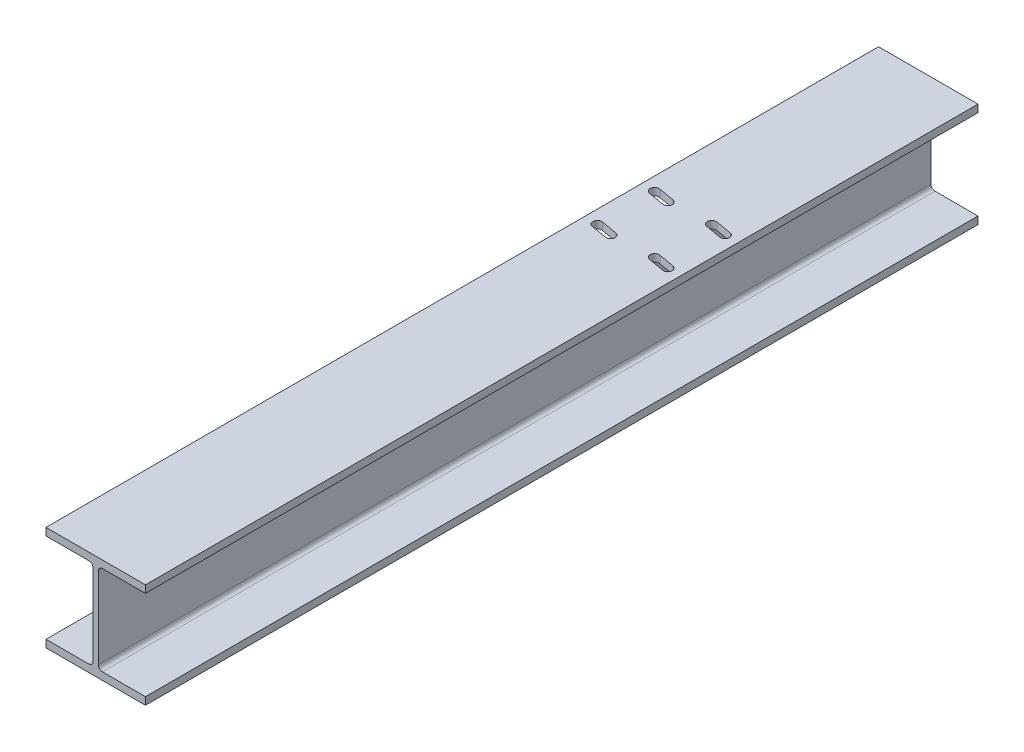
from build123d import *

# Parameters (mm, degrees)
BASESTEELW_DEPTH   = 646.51128
CUT_EXTRUDE1_REACH = 686.169


with BuildPart() as part:
    # Sketch1 → BaseSteelW (new, symmetric)
    with BuildSketch(Plane.XY):
        with BuildLine():
            Line((0, 0), (0, 11.557))
            Line((0, 11.557), (66.802, 11.557))
            ThreePointArc((66.802, 11.557), (71.292128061, 13.416871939), (73.152, 17.907))
            Line((73.152, 17.907), (73.152, 144.145))
            ThreePointArc((73.152, 144.145), (71.292128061, 148.635128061), (66.802, 150.495))
            Line((66.802, 150.495), (0, 150.495))
            Line((0, 150.495), (0, 162.052))
            Line((0, 162.052), (154.432, 162.052))
            Line((154.432, 162.052), (154.432, 150.495))
            Line((154.432, 150.495), (87.63, 150.495))
            ThreePointArc((87.63, 150.495), (83.139871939, 148.635128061), (81.28, 144.145))
            Line((81.28, 144.145), (81.28, 17.907))
            ThreePointArc((81.28, 17.907), (83.139871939, 13.416871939), (87.63, 11.557))
            Line((87.63, 11.557), (154.432, 11.557))
            Line((154.432, 11.557), (154.432, 0))
            Line((154.432, 0), (0, 0))
        make_face()
    extrude(amount=BASESTEELW_DEPTH, both=True)

    # Sketch2 → Cut-Extrude1 (cut, up to next)
    with BuildSketch(Plane(origin=(0, 162.052, 0), x_dir=(1, 0, 0), z_dir=(0, 1, 0)), mode=Mode.PRIVATE) as cut_extrude1_sk1:
        with BuildLine():
            Line((44.066928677, 178.293431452), (19.052796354, 182.704007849))
            ThreePointArc((19.052796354, 182.704007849), (13.417723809, 190.751665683), (21.465381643, 196.386738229))
            Line((21.465381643, 196.386738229), (46.479513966, 191.976161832))
            ThreePointArc((46.479513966, 191.976161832), (52.114586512, 183.928503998), (44.066928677, 178.293431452))
        make_face()
    cut_extrude1_tool1 = extrude(cut_extrude1_sk1.sketch, amount=-CUT_EXTRUDE1_REACH, mode=Mode.PRIVATE) & part.part
    # Sketch2 → Cut-Extrude1 (cut, up to next)
    with BuildSketch(Plane(origin=(0, 162.052, 0), x_dir=(1, 0, 0), z_dir=(0, 1, 0)), mode=Mode.PRIVATE) as cut_extrude1_sk2:
        with BuildLine():
            Line((44.066618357, 267.193431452), (19.052486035, 271.604007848))
            ThreePointArc((19.052486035, 271.604007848), (13.417413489, 279.651665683), (21.465071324, 285.286738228))
            Line((21.465071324, 285.286738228), (46.479203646, 280.876161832))
            ThreePointArc((46.479203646, 280.876161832), (52.114276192, 272.828503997), (44.066618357, 267.193431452))
        make_face()
    cut_extrude1_tool2 = extrude(cut_extrude1_sk2.sketch, amount=-CUT_EXTRUDE1_REACH, mode=Mode.PRIVATE) & part.part
    # Sketch2 → Cut-Extrude1 (cut, up to next)
    with BuildSketch(Plane(origin=(0, 162.052, 0), x_dir=(1, 0, 0), z_dir=(0, 1, 0)), mode=Mode.PRIVATE) as cut_extrude1_sk3:
        with BuildLine():
            Line((132.966618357, 267.193741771), (107.952486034, 271.604318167))
            ThreePointArc((107.952486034, 271.604318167), (102.317413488, 279.651976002), (110.365071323, 285.287048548))
            Line((110.365071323, 285.287048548), (135.379203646, 280.876472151))
            ThreePointArc((135.379203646, 280.876472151), (141.014276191, 272.828814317), (132.966618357, 267.193741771))
        make_face()
    cut_extrude1_tool3 = extrude(cut_extrude1_sk3.sketch, amount=-CUT_EXTRUDE1_REACH, mode=Mode.PRIVATE) & part.part
    # Sketch2 → Cut-Extrude1 (cut, up to next)
    with BuildSketch(Plane(origin=(0, 162.052, 0), x_dir=(1, 0, 0), z_dir=(0, 1, 0)), mode=Mode.PRIVATE) as cut_extrude1_sk4:
        with BuildLine():
            Line((132.966928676, 178.293741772), (107.952796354, 182.704318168))
            ThreePointArc((107.952796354, 182.704318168), (102.317723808, 190.751976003), (110.365381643, 196.387048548))
            Line((110.365381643, 196.387048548), (135.379513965, 191.976472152))
            ThreePointArc((135.379513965, 191.976472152), (141.014586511, 183.928814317), (132.966928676, 178.293741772))
        make_face()
    cut_extrude1_tool4 = extrude(cut_extrude1_sk4.sketch, amount=-CUT_EXTRUDE1_REACH, mode=Mode.PRIVATE) & part.part
    add(cut_extrude1_tool1.solids().sort_by_distance((32.766155, 162.052, -187.340085))[0], mode=Mode.SUBTRACT)
    add(cut_extrude1_tool2.solids().sort_by_distance((32.765845, 162.052, -276.240085))[0], mode=Mode.SUBTRACT)
    add(cut_extrude1_tool3.solids().sort_by_distance((121.665845, 162.052, -276.240395))[0], mode=Mode.SUBTRACT)
    add(cut_extrude1_tool4.solids().sort_by_distance((121.666155, 162.052, -187.340395))[0], mode=Mode.SUBTRACT)


solid = part.part
